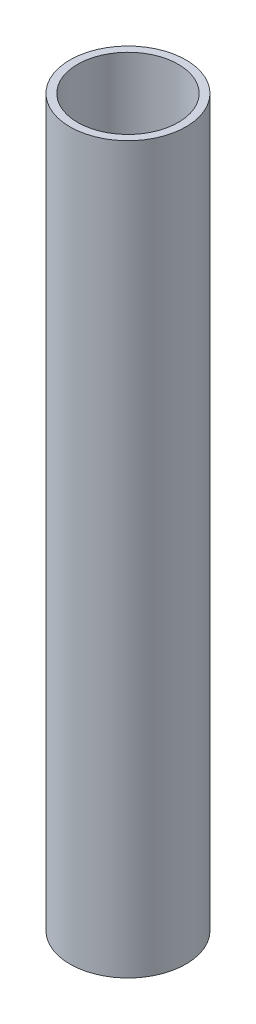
from build123d import *

# Parameters (mm, degrees)
ESQUISSE1_R      = 15.2
ESQUISSE1_R_2    = 13.2
EXTRUSION1_DEPTH = 190


with BuildPart() as part:
    # Esquisse1 → Extrusion1 (new body)
    with BuildSketch(Plane(origin=(0, 0, 0), x_dir=(1, 0, 0), z_dir=(0, 1, 0))):
        with Locations(Location((0, 0, 0), (0, 0, 270))):
            Circle(ESQUISSE1_R)
        with Locations(Location((0, 0, 0), (0, 0, 270))):
            Circle(ESQUISSE1_R_2, mode=Mode.SUBTRACT)
    extrude(amount=EXTRUSION1_DEPTH)


solid = part.part
